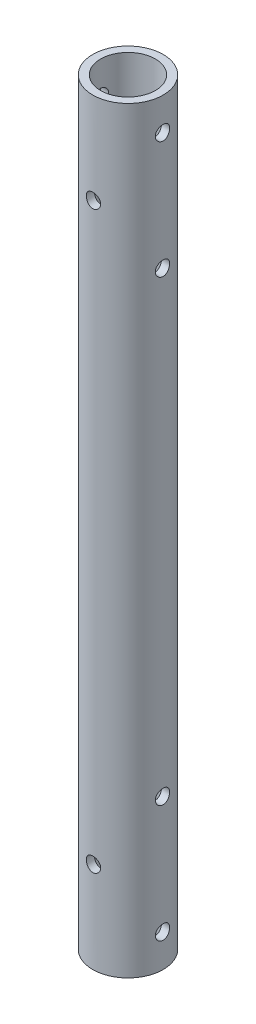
from build123d import *

# Parameters (mm, degrees)
SKETCH1_R               = 54
SKETCH1_R_2             = 42
BOSS_EXTRUDE1_DEPTH     = 581
SKETCH2_R               = 11
CUT_EXTRUDE1_DEPTH      = 100
SKETCH3_R               = 11
CUT_EXTRUDE2_DEPTH      = 100
LPATTERN1_COUNT         = 2
LPATTERN1_PITCH         = 180
MIRROR1_COPY_1_SKETCH_R = 11
MIRROR1_COPY_1_DEPTH    = 100


with BuildPart() as part:
    # Sketch1 → Boss-Extrude1 (new, symmetric)
    with BuildSketch(Plane(origin=(0, 0, 0), x_dir=(1, 0, 0), z_dir=(0, 1, 0))):
        with Locations(Location((0, 0, 0), (0, 0, 270))):
            Circle(SKETCH1_R)
        with Locations(Location((0, 0, 0), (0, 0, 270))):
            Circle(SKETCH1_R_2, mode=Mode.SUBTRACT)
    extrude(amount=BOSS_EXTRUDE1_DEPTH, both=True)

    # Sketch2 → Cut-Extrude1 (cut, symmetric)
    with BuildSketch(Plane(origin=(0, 0, 0), x_dir=(0, 0, -1), z_dir=(1, 0, 0))):
        with Locations((0, -531)):
            Circle(SKETCH2_R)
    cut_extrude1 = extrude(amount=CUT_EXTRUDE1_DEPTH, both=True, mode=Mode.SUBTRACT)

    # Sketch3 → Cut-Extrude2 (cut, symmetric)
    with BuildSketch(Plane.XY):
        with Locations((0, -441)):
            Circle(SKETCH3_R)
    cut_extrude2 = extrude(amount=CUT_EXTRUDE2_DEPTH, both=True, mode=Mode.SUBTRACT)

    # LPattern1: Cut-Extrude1 ×2
    with Locations(*[(0, i * LPATTERN1_PITCH, 0) for i in range(1, LPATTERN1_COUNT)]):
        add(cut_extrude1, mode=Mode.SUBTRACT)

    # Mirror1: Cut-Extrude1, Cut-Extrude2 across plane
    add(cut_extrude1.mirror(Plane.ZX), mode=Mode.SUBTRACT)
    add(cut_extrude2.mirror(Plane.ZX), mode=Mode.SUBTRACT)

    # Mirror1 copy 1 sketch → Mirror1 copy 1 (cut, symmetric)
    with BuildSketch(Plane(origin=(0, -180, 0), x_dir=(0, 0, -1), z_dir=(1, 0, 0))):
        with Locations((0, 531)):
            Circle(MIRROR1_COPY_1_SKETCH_R)
    extrude(amount=MIRROR1_COPY_1_DEPTH, both=True, mode=Mode.SUBTRACT)


solid = part.part
